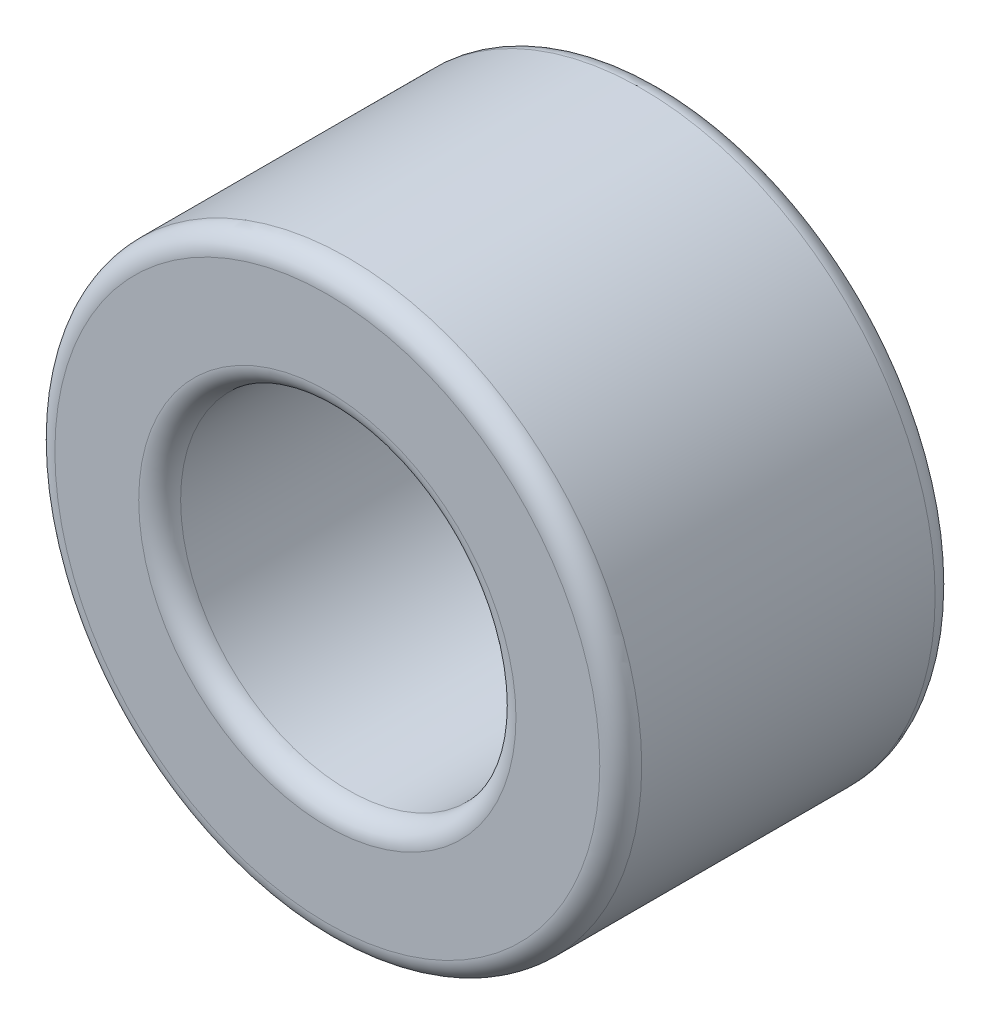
from build123d import *

# Parameters (mm, degrees)
SKETCH_1_W = 8
SKETCH_1_H = 3
FILLET_1_R = 0.5


with BuildPart() as part:
    # Sketch 1 → Revolve 1 (revolve)
    with BuildSketch(Plane(origin=(0, 0, 0), x_dir=(0, 0, -1), z_dir=(1, 0, 0)), mode=Mode.PRIVATE) as revolve_1_sk:
        with Locations((0, 5.5)):
            Rectangle(SKETCH_1_W, SKETCH_1_H)
    revolve(revolve_1_sk.sketch.rotate(Axis((0, 0, 4), (0, 0, -1)), 90), axis=Axis((0, 0, 4), (0, 0, -1)))

    # Fillet 1
    fillet_1_edges = [part.edges().sort_by_distance(p)[0] for p in [
        (-7, 0, 4),
        (-7, 0, -4),
        (-4, 0, -4),
        (-4, 0, 4),
    ]]
    fillet(fillet_1_edges, radius=FILLET_1_R)


solid = part.part
